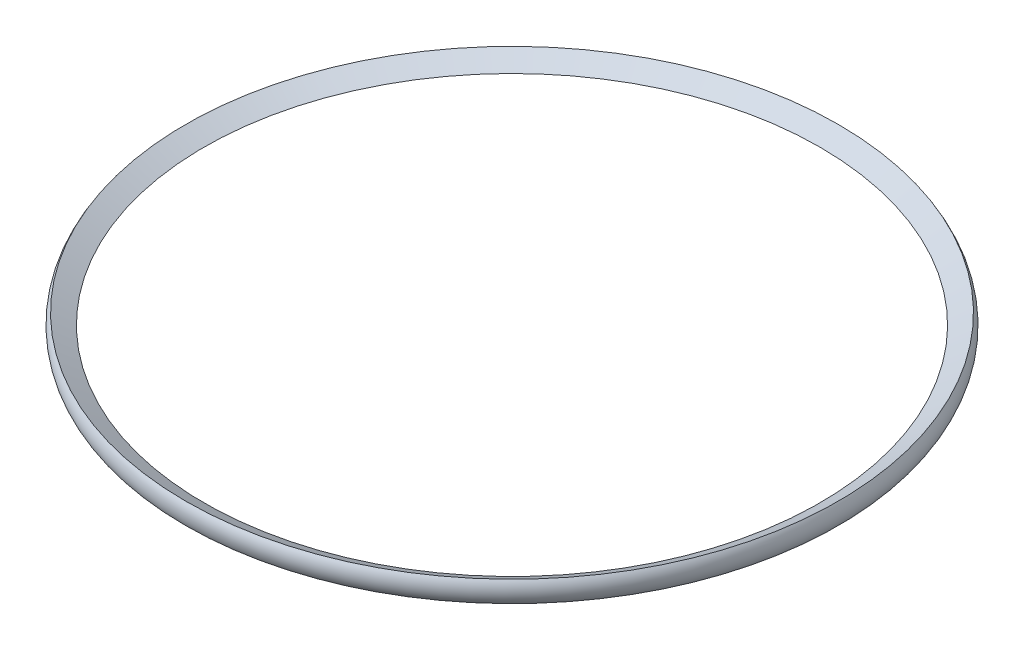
from build123d import *


with BuildPart() as part:
    # Sketch1 → Revolve1 (revolve)
    with BuildSketch(Plane.XY, mode=Mode.PRIVATE) as revolve1_sk:
        with BuildLine():
            Line((-103.3907, 0.145246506), (-109.5375, 3.69410314))
            ThreePointArc((-109.5375, 3.69410314), (-110.621750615, 0.145246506), (-109.5375, -3.403610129))
            Line((-109.5375, -3.403610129), (-103.3907, 0.145246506))
        make_face()
    revolve(revolve1_sk.sketch.rotate(Axis((0, 0, 0), (0, 1, 0)), 270), axis=Axis((0, 0, 0), (0, 1, 0)))


solid = part.part
